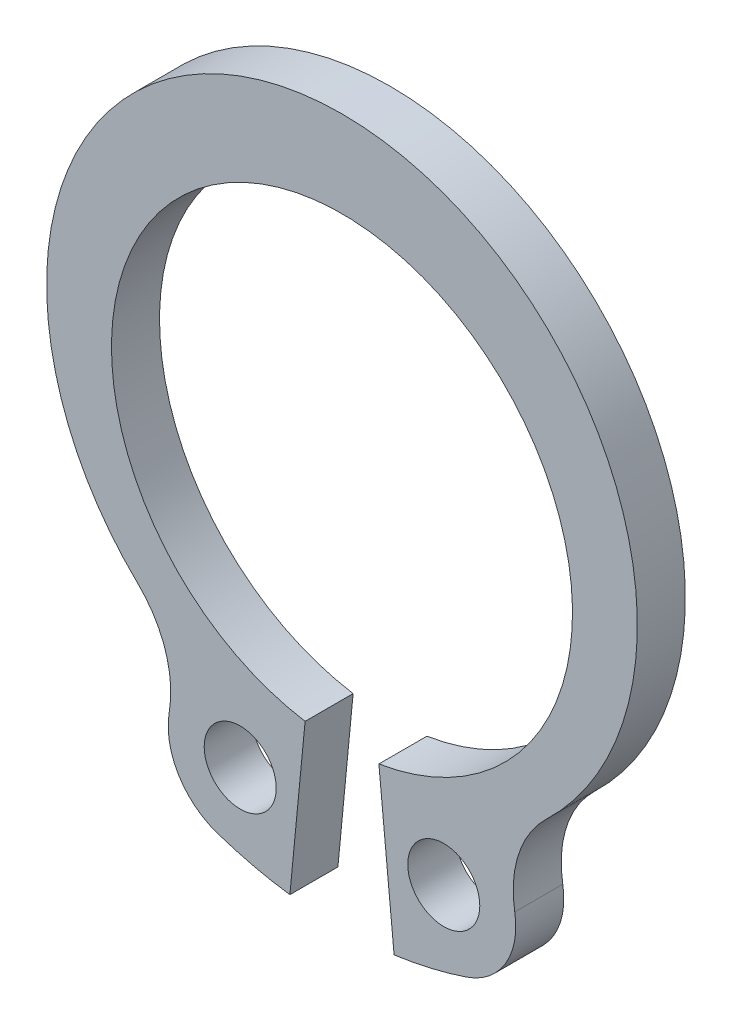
from build123d import *

# Parameters (mm, degrees)
ESQUISSE1_R          = 0.75
BASE_EXTRUSION_DEPTH = 1


with BuildPart() as part:
    # Esquisse1 → Base-Extrusion (new body)
    with BuildSketch(Plane.XY):
        with BuildLine():
            Line((0.768130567, -4.738140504), (1.084960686, -8.022896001))
            ThreePointArc((1.084960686, -8.022896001), (1.85160893, -7.881341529), (2.601087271, -7.666703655))
            ThreePointArc((2.601087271, -7.666703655), (3.408149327, -7.0133742), (3.597535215, -5.99243271))
            ThreePointArc((3.597535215, -5.99243271), (3.677955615, -4.908079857), (4.25748031, -3.988058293))
            ThreePointArc((4.25748031, -3.988058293), (0, 6.6), (-4.25748031, -3.988058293))
            ThreePointArc((-4.25748031, -3.988058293), (-3.677955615, -4.908079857), (-3.597535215, -5.99243271))
            ThreePointArc((-3.597535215, -5.99243271), (-3.408149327, -7.0133742), (-2.601087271, -7.666703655))
            ThreePointArc((-2.601087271, -7.666703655), (-1.85160893, -7.881341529), (-1.084960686, -8.022896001))
            Line((-1.084960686, -8.022896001), (-0.768130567, -4.738140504))
            ThreePointArc((-0.768130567, -4.738140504), (0, 4.8), (0.768130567, -4.738140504))
        make_face()
        with Locations((2.119161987, -6.24622908)):
            Circle(ESQUISSE1_R, mode=Mode.SUBTRACT)
        with Locations(Location((-2.119161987, -6.24622908, 0), (0, 0, 180))):
            Circle(ESQUISSE1_R, mode=Mode.SUBTRACT)
    extrude(amount=BASE_EXTRUSION_DEPTH)


solid = part.part
